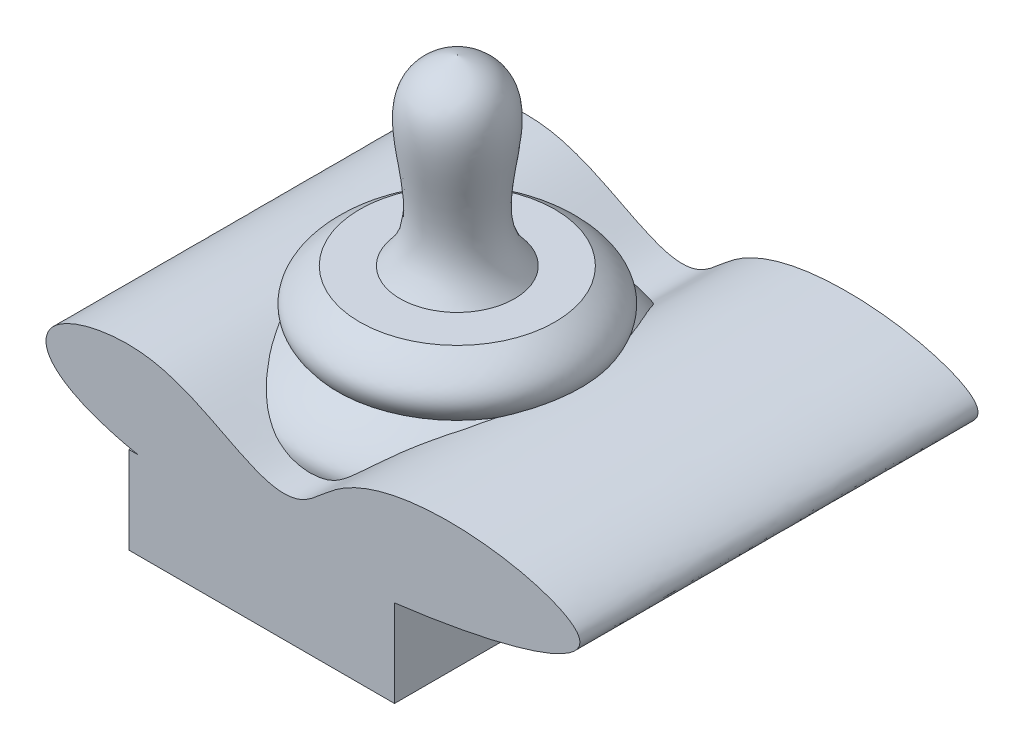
ISO-10303-21;
HEADER;
FILE_DESCRIPTION(('STEP AP214'),'2;1');
FILE_NAME('part.step','',(''),(''),'','','');
FILE_SCHEMA(('AUTOMOTIVE_DESIGN { 1 0 10303 214 1 1 1 1 }'));
ENDSEC;
DATA;
#1=APPLICATION_CONTEXT('core data for automotive mechanical design processes');
#2=APPLICATION_PROTOCOL_DEFINITION('international standard','automotive_design',2000,#1);
#3=PRODUCT_CONTEXT('',#1,'mechanical');
#4=PRODUCT('Part','Part','',(#3));
#5=PRODUCT_RELATED_PRODUCT_CATEGORY('part','',(#4));
#6=PRODUCT_DEFINITION_FORMATION('','',#4);
#7=PRODUCT_DEFINITION_CONTEXT('part definition',#1,'design');
#8=PRODUCT_DEFINITION('design','',#6,#7);
#9=PRODUCT_DEFINITION_SHAPE('','',#8);
#10=(LENGTH_UNIT() NAMED_UNIT(*) SI_UNIT(.MILLI.,.METRE.));
#11=(NAMED_UNIT(*) PLANE_ANGLE_UNIT() SI_UNIT($,.RADIAN.));
#12=(NAMED_UNIT(*) SI_UNIT($,.STERADIAN.) SOLID_ANGLE_UNIT());
#13=UNCERTAINTY_MEASURE_WITH_UNIT(LENGTH_MEASURE(1.E-05),#10,'distance_accuracy_value','');
#14=(GEOMETRIC_REPRESENTATION_CONTEXT(3) GLOBAL_UNCERTAINTY_ASSIGNED_CONTEXT((#13)) GLOBAL_UNIT_ASSIGNED_CONTEXT((#10,
#11,#12)) REPRESENTATION_CONTEXT('',''));
#15=CARTESIAN_POINT('',(0.,0.,0.));
#16=DIRECTION('',(0.,0.,1.));
#17=DIRECTION('',(1.,0.,0.));
#18=AXIS2_PLACEMENT_3D('',#15,#16,#17);
#19=CARTESIAN_POINT('',(40.5248565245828,-44.2544368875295,-68.58));
#20=CARTESIAN_POINT('',(76.2242671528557,-39.7793377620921,-68.58));
#21=CARTESIAN_POINT('',(138.30260492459,-22.106306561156,-68.58));
#22=CARTESIAN_POINT('',(36.7444815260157,-3.70843179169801,-68.58));
#23=CARTESIAN_POINT('',(1.99739390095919,-41.8241778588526,-68.58));
#24=CARTESIAN_POINT('',(-27.4241175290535,-7.62554108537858,-68.58));
#25=CARTESIAN_POINT('',(-69.1515253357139,-17.6357139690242,-68.58));
#26=CARTESIAN_POINT('',(-76.3895720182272,-32.6990033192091,-68.58));
#27=CARTESIAN_POINT('',(-60.6891643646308,-40.7625866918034,-68.58));
#28=CARTESIAN_POINT('',(-42.8345676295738,-44.2544368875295,-68.58));
#29=B_SPLINE_CURVE_WITH_KNOTS('',3,(#19,#20,#21,#22,#23,#24,#25,#26,#27,#28),.UNSPECIFIED.,.F.,
.F.,(4,1,1,1,1,1,1,4),(0.,0.201465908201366,0.425418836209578,0.462952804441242,
0.614503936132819,0.700353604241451,0.723135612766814,0.842324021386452),.UNSPECIFIED.);
#30=DIRECTION('',(0.,0.,1.));
#31=VECTOR('',#30,1.);
#32=SURFACE_OF_LINEAR_EXTRUSION('',#29,#31);
#33=DIRECTION('',(0.,0.,1.));
#34=VECTOR('',#33,1.);
#35=CARTESIAN_POINT('',(-42.8345676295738,-44.2544368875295,-68.58));
#36=LINE('',#35,#34);
#37=CARTESIAN_POINT('',(-42.8345676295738,-44.2544368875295,-68.58));
#38=VERTEX_POINT('',#37);
#39=CARTESIAN_POINT('',(-42.8345676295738,-44.2544368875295,60.96));
#40=VERTEX_POINT('',#39);
#41=EDGE_CURVE('E47',#38,#40,#36,.T.);
#42=ORIENTED_EDGE('',*,*,#41,.T.);
#43=CARTESIAN_POINT('',(40.5248565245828,-44.2544368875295,60.96));
#44=CARTESIAN_POINT('',(76.2242671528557,-39.7793377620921,60.96));
#45=CARTESIAN_POINT('',(138.30260492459,-22.106306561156,60.96));
#46=CARTESIAN_POINT('',(36.7444815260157,-3.70843179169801,60.96));
#47=CARTESIAN_POINT('',(1.99739390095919,-41.8241778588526,60.96));
#48=CARTESIAN_POINT('',(-27.4241175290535,-7.62554108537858,60.96));
#49=CARTESIAN_POINT('',(-69.1515253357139,-17.6357139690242,60.96));
#50=CARTESIAN_POINT('',(-76.3895720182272,-32.6990033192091,60.96));
#51=CARTESIAN_POINT('',(-60.6891643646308,-40.7625866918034,60.96));
#52=CARTESIAN_POINT('',(-42.8345676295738,-44.2544368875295,60.96));
#53=B_SPLINE_CURVE_WITH_KNOTS('',3,(#43,#44,#45,#46,#47,#48,#49,#50,#51,#52),.UNSPECIFIED.,.F.,
.F.,(4,1,1,1,1,1,1,4),(0.,0.201465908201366,0.425418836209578,0.462952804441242,
0.614503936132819,0.700353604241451,0.723135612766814,0.842324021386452),.UNSPECIFIED.);
#54=CARTESIAN_POINT('',(40.5248565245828,-44.2544368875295,60.96));
#55=VERTEX_POINT('',#54);
#56=EDGE_CURVE('E90',#55,#40,#53,.T.);
#57=ORIENTED_EDGE('',*,*,#56,.F.);
#58=DIRECTION('',(0.,0.,1.));
#59=VECTOR('',#58,1.);
#60=CARTESIAN_POINT('',(40.5248565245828,-44.2544368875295,-68.58));
#61=LINE('',#60,#59);
#62=CARTESIAN_POINT('',(40.5248565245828,-44.2544368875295,-68.58));
#63=VERTEX_POINT('',#62);
#64=EDGE_CURVE('E12',#63,#55,#61,.T.);
#65=ORIENTED_EDGE('',*,*,#64,.F.);
#66=EDGE_CURVE('E91',#63,#38,#29,.T.);
#67=ORIENTED_EDGE('',*,*,#66,.T.);
#68=EDGE_LOOP('',(#42,#57,#65,#67));
#69=FACE_BOUND('',#68,.T.);
#70=ADVANCED_FACE('F43',(#69),#32,.T.);
#71=CARTESIAN_POINT('',(40.5248565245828,-44.2544368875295,-68.58));
#72=DIRECTION('',(1.,0.,0.));
#73=DIRECTION('',(0.,0.,-1.));
#74=AXIS2_PLACEMENT_3D('',#71,#72,#73);
#75=PLANE('',#74);
#76=ORIENTED_EDGE('',*,*,#64,.T.);
#77=DIRECTION('',(0.,1.,0.));
#78=VECTOR('',#77,1.);
#79=CARTESIAN_POINT('',(40.5248565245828,-44.2544368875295,60.96));
#80=LINE('',#79,#78);
#81=CARTESIAN_POINT('',(40.5248565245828,-72.6163477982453,60.96));
#82=VERTEX_POINT('',#81);
#83=EDGE_CURVE('E108',#82,#55,#80,.T.);
#84=ORIENTED_EDGE('',*,*,#83,.F.);
#85=DIRECTION('',(0.,0.,1.));
#86=VECTOR('',#85,1.);
#87=CARTESIAN_POINT('',(40.5248565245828,-72.6163477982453,-68.58));
#88=LINE('',#87,#86);
#89=CARTESIAN_POINT('',(40.5248565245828,-72.6163477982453,-68.58));
#90=VERTEX_POINT('',#89);
#91=EDGE_CURVE('E52',#90,#82,#88,.T.);
#92=ORIENTED_EDGE('',*,*,#91,.F.);
#93=DIRECTION('',(0.,1.,0.));
#94=VECTOR('',#93,1.);
#95=CARTESIAN_POINT('',(40.5248565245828,-44.2544368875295,-68.58));
#96=LINE('',#95,#94);
#97=EDGE_CURVE('E96',#90,#63,#96,.T.);
#98=ORIENTED_EDGE('',*,*,#97,.T.);
#99=EDGE_LOOP('',(#76,#84,#92,#98));
#100=FACE_BOUND('',#99,.T.);
#101=ADVANCED_FACE('F146',(#100),#75,.T.);
#102=CARTESIAN_POINT('',(40.5248565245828,-72.6163477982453,-68.58));
#103=DIRECTION('',(0.,-1.,0.));
#104=DIRECTION('',(0.,0.,-1.));
#105=AXIS2_PLACEMENT_3D('',#102,#103,#104);
#106=PLANE('',#105);
#107=ORIENTED_EDGE('',*,*,#91,.T.);
#108=DIRECTION('',(1.,0.,0.));
#109=VECTOR('',#108,1.);
#110=CARTESIAN_POINT('',(40.5248565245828,-72.6163477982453,60.96));
#111=LINE('',#110,#109);
#112=CARTESIAN_POINT('',(-45.8576881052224,-72.6163477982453,60.96));
#113=VERTEX_POINT('',#112);
#114=EDGE_CURVE('E117',#113,#82,#111,.T.);
#115=ORIENTED_EDGE('',*,*,#114,.F.);
#116=DIRECTION('',(0.,0.,1.));
#117=VECTOR('',#116,1.);
#118=CARTESIAN_POINT('',(-45.8576881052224,-72.6163477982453,-68.58));
#119=LINE('',#118,#117);
#120=CARTESIAN_POINT('',(-45.8576881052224,-72.6163477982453,-68.58));
#121=VERTEX_POINT('',#120);
#122=EDGE_CURVE('E135',#121,#113,#119,.T.);
#123=ORIENTED_EDGE('',*,*,#122,.F.);
#124=DIRECTION('',(1.,0.,0.));
#125=VECTOR('',#124,1.);
#126=CARTESIAN_POINT('',(40.5248565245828,-72.6163477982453,-68.58));
#127=LINE('',#126,#125);
#128=EDGE_CURVE('E131',#121,#90,#127,.T.);
#129=ORIENTED_EDGE('',*,*,#128,.T.);
#130=EDGE_LOOP('',(#107,#115,#123,#129));
#131=FACE_BOUND('',#130,.T.);
#132=ADVANCED_FACE('F142',(#131),#106,.T.);
#133=CARTESIAN_POINT('',(-45.8576881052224,-44.2544368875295,-68.58));
#134=DIRECTION('',(-1.,0.,0.));
#135=DIRECTION('',(0.,0.,1.));
#136=AXIS2_PLACEMENT_3D('',#133,#134,#135);
#137=PLANE('',#136);
#138=ORIENTED_EDGE('',*,*,#122,.T.);
#139=DIRECTION('',(0.,-1.,0.));
#140=VECTOR('',#139,1.);
#141=CARTESIAN_POINT('',(-45.8576881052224,-44.2544368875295,60.96));
#142=LINE('',#141,#140);
#143=CARTESIAN_POINT('',(-45.8576881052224,-44.2544368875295,60.96));
#144=VERTEX_POINT('',#143);
#145=EDGE_CURVE('E103',#144,#113,#142,.T.);
#146=ORIENTED_EDGE('',*,*,#145,.F.);
#147=DIRECTION('',(0.,0.,1.));
#148=VECTOR('',#147,1.);
#149=CARTESIAN_POINT('',(-45.8576881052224,-44.2544368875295,-68.58));
#150=LINE('',#149,#148);
#151=CARTESIAN_POINT('',(-45.8576881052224,-44.2544368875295,-68.58));
#152=VERTEX_POINT('',#151);
#153=EDGE_CURVE('E95',#152,#144,#150,.T.);
#154=ORIENTED_EDGE('',*,*,#153,.F.);
#155=DIRECTION('',(0.,-1.,0.));
#156=VECTOR('',#155,1.);
#157=CARTESIAN_POINT('',(-45.8576881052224,-44.2544368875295,-68.58));
#158=LINE('',#157,#156);
#159=EDGE_CURVE('E128',#152,#121,#158,.T.);
#160=ORIENTED_EDGE('',*,*,#159,.T.);
#161=EDGE_LOOP('',(#138,#146,#154,#160));
#162=FACE_BOUND('',#161,.T.);
#163=ADVANCED_FACE('F137',(#162),#137,.T.);
#164=CARTESIAN_POINT('',(-42.8345676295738,-44.2544368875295,-68.58));
#165=DIRECTION('',(0.,1.,0.));
#166=DIRECTION('',(0.,0.,1.));
#167=AXIS2_PLACEMENT_3D('',#164,#165,#166);
#168=PLANE('',#167);
#169=ORIENTED_EDGE('',*,*,#153,.T.);
#170=DIRECTION('',(-1.,0.,0.));
#171=VECTOR('',#170,1.);
#172=CARTESIAN_POINT('',(-42.8345676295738,-44.2544368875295,60.96));
#173=LINE('',#172,#171);
#174=EDGE_CURVE('E98',#40,#144,#173,.T.);
#175=ORIENTED_EDGE('',*,*,#174,.F.);
#176=ORIENTED_EDGE('',*,*,#41,.F.);
#177=DIRECTION('',(-1.,0.,0.));
#178=VECTOR('',#177,1.);
#179=CARTESIAN_POINT('',(-42.8345676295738,-44.2544368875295,-68.58));
#180=LINE('',#179,#178);
#181=EDGE_CURVE('E123',#38,#152,#180,.T.);
#182=ORIENTED_EDGE('',*,*,#181,.T.);
#183=EDGE_LOOP('',(#169,#175,#176,#182));
#184=FACE_BOUND('',#183,.T.);
#185=ADVANCED_FACE('F99',(#184),#168,.T.);
#186=CARTESIAN_POINT('',(23.1404000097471,-20.7135317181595,-68.58));
#187=DIRECTION('',(0.,0.,1.));
#188=DIRECTION('',(1.,0.,0.));
#189=AXIS2_PLACEMENT_3D('',#186,#187,#188);
#190=PLANE('',#189);
#191=ORIENTED_EDGE('',*,*,#66,.F.);
#192=ORIENTED_EDGE('',*,*,#97,.F.);
#193=ORIENTED_EDGE('',*,*,#128,.F.);
#194=ORIENTED_EDGE('',*,*,#159,.F.);
#195=ORIENTED_EDGE('',*,*,#181,.F.);
#196=EDGE_LOOP('',(#191,#192,#193,#194,#195));
#197=FACE_BOUND('',#196,.T.);
#198=ADVANCED_FACE('F145',(#197),#190,.F.);
#199=CARTESIAN_POINT('',(23.1404000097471,-20.7135317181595,60.96));
#200=DIRECTION('',(0.,0.,1.));
#201=DIRECTION('',(1.,0.,0.));
#202=AXIS2_PLACEMENT_3D('',#199,#200,#201);
#203=PLANE('',#202);
#204=ORIENTED_EDGE('',*,*,#56,.T.);
#205=ORIENTED_EDGE('',*,*,#174,.T.);
#206=ORIENTED_EDGE('',*,*,#145,.T.);
#207=ORIENTED_EDGE('',*,*,#114,.T.);
#208=ORIENTED_EDGE('',*,*,#83,.T.);
#209=EDGE_LOOP('',(#204,#205,#206,#207,#208));
#210=FACE_BOUND('',#209,.T.);
#211=ADVANCED_FACE('F106',(#210),#203,.T.);
#212=CLOSED_SHELL('',(#70,#101,#132,#163,#185,#198,#211));
#213=MANIFOLD_SOLID_BREP('B2',#212);
#214=CARTESIAN_POINT('',(0.,-54.3885683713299,0.));
#215=CARTESIAN_POINT('',(21.5731329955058,-74.2422715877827,0.));
#216=CARTESIAN_POINT('',(12.8614209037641,-50.5304007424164,0.));
#217=CARTESIAN_POINT('',(21.5752592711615,-21.9396593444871,0.));
#218=CARTESIAN_POINT('',(55.0698736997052,-14.2399246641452,0.));
#219=CARTESIAN_POINT('',(31.7660497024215,0.,0.));
#220=B_SPLINE_CURVE_WITH_KNOTS('',3,(#214,#215,#216,#217,#218,#219),.UNSPECIFIED.,.F.,.F.,(4,1,
1,4),(0.,0.372485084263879,0.518062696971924,1.),.UNSPECIFIED.);
#221=CARTESIAN_POINT('',(0.,0.,0.));
#222=DIRECTION('',(0.,1.,0.));
#223=AXIS1_PLACEMENT('',#221,#222);
#224=SURFACE_OF_REVOLUTION('',#220,#223);
#225=CARTESIAN_POINT('',(0.,-16.0703429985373,0.));
#226=DIRECTION('',(0.,-1.,0.));
#227=DIRECTION('',(0.,0.,-1.));
#228=AXIS2_PLACEMENT_3D('',#225,#226,#227);
#229=CIRCLE('',#228,38.9242247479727);
#230=CARTESIAN_POINT('',(0.,-16.0703429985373,-38.9242247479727));
#231=VERTEX_POINT('',#230);
#232=EDGE_CURVE('E231',#231,#231,#229,.F.);
#233=ORIENTED_EDGE('',*,*,#232,.T.);
#234=EDGE_LOOP('',(#233));
#235=FACE_BOUND('',#234,.T.);
#236=CARTESIAN_POINT('',(0.,0.,0.));
#237=DIRECTION('',(0.,1.,0.));
#238=DIRECTION('',(0.,0.,1.));
#239=AXIS2_PLACEMENT_3D('',#236,#237,#238);
#240=CIRCLE('',#239,31.7660497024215);
#241=CARTESIAN_POINT('',(0.,0.,31.7660497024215));
#242=VERTEX_POINT('',#241);
#243=EDGE_CURVE('E41',#242,#242,#240,.T.);
#244=ORIENTED_EDGE('',*,*,#243,.F.);
#245=EDGE_LOOP('',(#244));
#246=FACE_BOUND('',#245,.T.);
#247=ADVANCED_FACE('F204',(#235,#246),#224,.T.);
#248=CARTESIAN_POINT('',(0.,0.,0.));
#249=DIRECTION('',(0.,-1.,0.));
#250=DIRECTION('',(0.,0.,-1.));
#251=AXIS2_PLACEMENT_3D('',#248,#249,#250);
#252=PLANE('',#251);
#253=CARTESIAN_POINT('',(0.,0.,0.));
#254=DIRECTION('',(0.,-1.,0.));
#255=DIRECTION('',(0.,0.,-1.));
#256=AXIS2_PLACEMENT_3D('',#253,#254,#255);
#257=CIRCLE('',#256,18.6280170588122);
#258=CARTESIAN_POINT('',(0.,0.,-18.6280170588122));
#259=VERTEX_POINT('',#258);
#260=EDGE_CURVE('E229',#259,#259,#257,.T.);
#261=ORIENTED_EDGE('',*,*,#260,.T.);
#262=EDGE_LOOP('',(#261));
#263=FACE_BOUND('',#262,.T.);
#264=ORIENTED_EDGE('',*,*,#243,.T.);
#265=EDGE_LOOP('',(#264));
#266=FACE_BOUND('',#265,.T.);
#267=ADVANCED_FACE('F224',(#263,#266),#252,.F.);
#268=CARTESIAN_POINT('',(27.7373315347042,-46.5392513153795,0.));
#269=CARTESIAN_POINT('',(83.9406111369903,-25.5090809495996,0.));
#270=CARTESIAN_POINT('',(-21.0612261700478,-11.1361543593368,0.));
#271=CARTESIAN_POINT('',(27.6228617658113,52.6903765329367,0.));
#272=CARTESIAN_POINT('',(0.,59.3094877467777,0.));
#273=B_SPLINE_CURVE_WITH_KNOTS('',3,(#268,#269,#270,#271,#272),.UNSPECIFIED.,.F.,.F.,(4,1,4),
(0.,0.579051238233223,1.),.UNSPECIFIED.);
#274=CARTESIAN_POINT('',(0.,-46.5392513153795,0.));
#275=DIRECTION('',(0.,-1.,0.));
#276=AXIS1_PLACEMENT('',#274,#275);
#277=SURFACE_OF_REVOLUTION('',#273,#276);
#278=CARTESIAN_POINT('',(0.,59.3094877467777,0.));
#279=VERTEX_POINT('',#278);
#280=VERTEX_LOOP('',#279);
#281=FACE_BOUND('',#280,.T.);
#282=ORIENTED_EDGE('',*,*,#260,.F.);
#283=EDGE_LOOP('',(#282));
#284=FACE_BOUND('',#283,.T.);
#285=ADVANCED_FACE('F220',(#281,#284),#277,.F.);
#286=CARTESIAN_POINT('',(0.,-46.5392513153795,0.));
#287=DIRECTION('',(0.,-1.,0.));
#288=DIRECTION('',(0.,0.,-1.));
#289=AXIS2_PLACEMENT_3D('',#286,#287,#288);
#290=PLANE('',#289);
#291=CARTESIAN_POINT('',(0.,-46.5392513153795,0.));
#292=DIRECTION('',(0.,-1.,0.));
#293=DIRECTION('',(0.,0.,-1.));
#294=AXIS2_PLACEMENT_3D('',#291,#292,#293);
#295=CIRCLE('',#294,27.7373315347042);
#296=CARTESIAN_POINT('',(0.,-46.5392513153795,-27.7373315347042));
#297=VERTEX_POINT('',#296);
#298=EDGE_CURVE('E232',#297,#297,#295,.T.);
#299=ORIENTED_EDGE('',*,*,#298,.T.);
#300=EDGE_LOOP('',(#299));
#301=FACE_BOUND('',#300,.T.);
#302=CARTESIAN_POINT('',(0.,-46.5392513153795,0.));
#303=DIRECTION('',(0.,1.,0.));
#304=DIRECTION('',(0.,0.,1.));
#305=AXIS2_PLACEMENT_3D('',#302,#303,#304);
#306=CIRCLE('',#305,15.8438552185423);
#307=CARTESIAN_POINT('',(0.,-46.5392513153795,15.8438552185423));
#308=VERTEX_POINT('',#307);
#309=EDGE_CURVE('E209',#308,#308,#306,.F.);
#310=ORIENTED_EDGE('',*,*,#309,.F.);
#311=EDGE_LOOP('',(#310));
#312=FACE_BOUND('',#311,.T.);
#313=ADVANCED_FACE('F223',(#301,#312),#290,.T.);
#314=ORIENTED_EDGE('',*,*,#298,.F.);
#315=EDGE_LOOP('',(#314));
#316=FACE_BOUND('',#315,.T.);
#317=ORIENTED_EDGE('',*,*,#232,.F.);
#318=EDGE_LOOP('',(#317));
#319=FACE_BOUND('',#318,.T.);
#320=ADVANCED_FACE('F226',(#316,#319),#277,.F.);
#321=ORIENTED_EDGE('',*,*,#309,.T.);
#322=EDGE_LOOP('',(#321));
#323=FACE_BOUND('',#322,.T.);
#324=CARTESIAN_POINT('',(0.,-54.3885683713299,0.));
#325=VERTEX_POINT('',#324);
#326=VERTEX_LOOP('',#325);
#327=FACE_BOUND('',#326,.T.);
#328=ADVANCED_FACE('F206',(#323,#327),#224,.T.);
#329=CLOSED_SHELL('',(#247,#267,#285,#313,#320,#328));
#330=MANIFOLD_SOLID_BREP('B6',#329);
#331=ADVANCED_BREP_SHAPE_REPRESENTATION('',(#18,#213,#330),#14);
#332=SHAPE_DEFINITION_REPRESENTATION(#9,#331);
ENDSEC;
END-ISO-10303-21;
